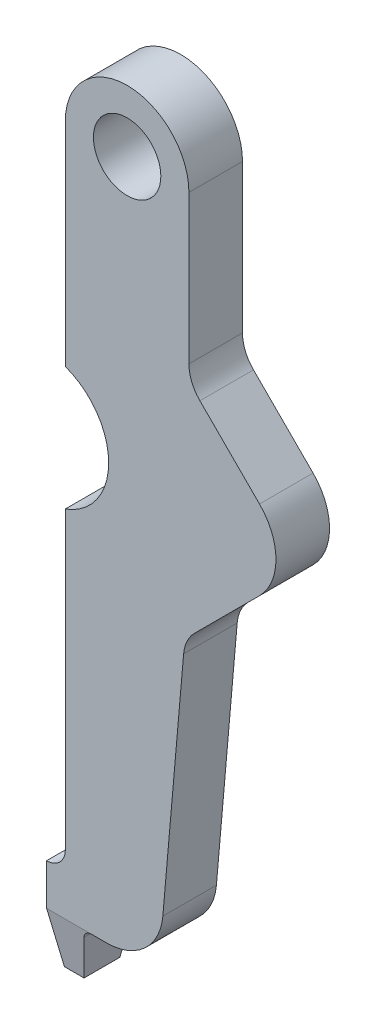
ISO-10303-21;
HEADER;
FILE_DESCRIPTION(('STEP AP214'),'2;1');
FILE_NAME('part.step','',(''),(''),'','','');
FILE_SCHEMA(('AUTOMOTIVE_DESIGN { 1 0 10303 214 1 1 1 1 }'));
ENDSEC;
DATA;
#1=APPLICATION_CONTEXT('core data for automotive mechanical design processes');
#2=APPLICATION_PROTOCOL_DEFINITION('international standard','automotive_design',2000,#1);
#3=PRODUCT_CONTEXT('',#1,'mechanical');
#4=PRODUCT('Part','Part','',(#3));
#5=PRODUCT_RELATED_PRODUCT_CATEGORY('part','',(#4));
#6=PRODUCT_DEFINITION_FORMATION('','',#4);
#7=PRODUCT_DEFINITION_CONTEXT('part definition',#1,'design');
#8=PRODUCT_DEFINITION('design','',#6,#7);
#9=PRODUCT_DEFINITION_SHAPE('','',#8);
#10=(LENGTH_UNIT() NAMED_UNIT(*) SI_UNIT(.MILLI.,.METRE.));
#11=(NAMED_UNIT(*) PLANE_ANGLE_UNIT() SI_UNIT($,.RADIAN.));
#12=(NAMED_UNIT(*) SI_UNIT($,.STERADIAN.) SOLID_ANGLE_UNIT());
#13=UNCERTAINTY_MEASURE_WITH_UNIT(LENGTH_MEASURE(1.E-05),#10,'distance_accuracy_value','');
#14=(GEOMETRIC_REPRESENTATION_CONTEXT(3) GLOBAL_UNCERTAINTY_ASSIGNED_CONTEXT((#13)) GLOBAL_UNIT_ASSIGNED_CONTEXT((#10,
#11,#12)) REPRESENTATION_CONTEXT('',''));
#15=CARTESIAN_POINT('',(0.,0.,0.));
#16=DIRECTION('',(0.,0.,1.));
#17=DIRECTION('',(1.,0.,0.));
#18=AXIS2_PLACEMENT_3D('',#15,#16,#17);
#19=CARTESIAN_POINT('',(0.,0.,1.8161));
#20=DIRECTION('',(1.,0.,0.));
#21=DIRECTION('',(0.,0.,-1.));
#22=AXIS2_PLACEMENT_3D('',#19,#20,#21);
#23=PLANE('',#22);
#24=DIRECTION('',(0.,-1.,0.));
#25=VECTOR('',#24,1.);
#26=CARTESIAN_POINT('',(0.,0.,-1.8161));
#27=LINE('',#26,#25);
#28=CARTESIAN_POINT('',(0.,44.069,-1.8161));
#29=VERTEX_POINT('',#28);
#30=CARTESIAN_POINT('',(0.,29.6532687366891,-1.8161));
#31=VERTEX_POINT('',#30);
#32=EDGE_CURVE('E187',#29,#31,#27,.T.);
#33=ORIENTED_EDGE('',*,*,#32,.T.);
#34=DIRECTION('',(0.,0.,1.));
#35=VECTOR('',#34,1.);
#36=CARTESIAN_POINT('',(0.,29.6532687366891,-1.8161));
#37=LINE('',#36,#35);
#38=CARTESIAN_POINT('',(0.,29.6532687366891,1.8161));
#39=VERTEX_POINT('',#38);
#40=EDGE_CURVE('E58',#31,#39,#37,.T.);
#41=ORIENTED_EDGE('',*,*,#40,.T.);
#42=DIRECTION('',(0.,-1.,0.));
#43=VECTOR('',#42,1.);
#44=CARTESIAN_POINT('',(0.,0.,1.8161));
#45=LINE('',#44,#43);
#46=CARTESIAN_POINT('',(0.,44.069,1.8161));
#47=VERTEX_POINT('',#46);
#48=EDGE_CURVE('E200',#47,#39,#45,.T.);
#49=ORIENTED_EDGE('',*,*,#48,.F.);
#50=DIRECTION('',(0.,0.,-1.));
#51=VECTOR('',#50,1.);
#52=CARTESIAN_POINT('',(0.,44.069,1.8161));
#53=LINE('',#52,#51);
#54=EDGE_CURVE('E203',#47,#29,#53,.T.);
#55=ORIENTED_EDGE('',*,*,#54,.T.);
#56=EDGE_LOOP('',(#33,#41,#49,#55));
#57=FACE_BOUND('',#56,.T.);
#58=ADVANCED_FACE('F41',(#57),#23,.F.);
#59=CARTESIAN_POINT('',(6.5532,-2.794,1.8161));
#60=DIRECTION('',(0.,1.,0.));
#61=DIRECTION('',(-1.,0.,0.));
#62=AXIS2_PLACEMENT_3D('',#59,#60,#61);
#63=PLANE('',#62);
#64=DIRECTION('',(-1.,0.,0.));
#65=VECTOR('',#64,1.);
#66=CARTESIAN_POINT('',(6.5532,-2.794,1.8161));
#67=LINE('',#66,#65);
#68=CARTESIAN_POINT('',(2.81753490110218,-2.794,1.8161));
#69=VERTEX_POINT('',#68);
#70=CARTESIAN_POINT('',(1.80282826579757,-2.794,1.8161));
#71=VERTEX_POINT('',#70);
#72=EDGE_CURVE('E251',#69,#71,#67,.T.);
#73=ORIENTED_EDGE('',*,*,#72,.T.);
#74=DIRECTION('',(0.,0.,-1.));
#75=VECTOR('',#74,1.);
#76=CARTESIAN_POINT('',(1.80282826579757,-2.794,-1.8161));
#77=LINE('',#76,#75);
#78=CARTESIAN_POINT('',(1.80282826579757,-2.794,-1.8161));
#79=VERTEX_POINT('',#78);
#80=EDGE_CURVE('E227',#71,#79,#77,.T.);
#81=ORIENTED_EDGE('',*,*,#80,.T.);
#82=DIRECTION('',(1.,0.,0.));
#83=VECTOR('',#82,1.);
#84=CARTESIAN_POINT('',(6.5532,-2.794,-1.8161));
#85=LINE('',#84,#83);
#86=CARTESIAN_POINT('',(2.81753490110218,-2.794,-1.8161));
#87=VERTEX_POINT('',#86);
#88=EDGE_CURVE('E211',#79,#87,#85,.T.);
#89=ORIENTED_EDGE('',*,*,#88,.T.);
#90=DIRECTION('',(0.,0.,1.));
#91=VECTOR('',#90,1.);
#92=CARTESIAN_POINT('',(2.81753490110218,-2.794,1.8161));
#93=LINE('',#92,#91);
#94=EDGE_CURVE('E282',#87,#69,#93,.T.);
#95=ORIENTED_EDGE('',*,*,#94,.T.);
#96=EDGE_LOOP('',(#73,#81,#89,#95));
#97=FACE_BOUND('',#96,.T.);
#98=ADVANCED_FACE('F317',(#97),#63,.F.);
#99=CARTESIAN_POINT('',(8.10282910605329,17.7123417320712,1.8161));
#100=DIRECTION('',(-0.996194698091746,0.0871557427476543,0.));
#101=DIRECTION('',(-0.0871557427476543,-0.996194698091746,0.));
#102=AXIS2_PLACEMENT_3D('',#99,#100,#101);
#103=PLANE('',#102);
#104=DIRECTION('',(0.0871557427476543,0.996194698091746,0.));
#105=VECTOR('',#104,1.);
#106=CARTESIAN_POINT('',(8.10282910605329,17.7123417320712,1.8161));
#107=LINE('',#106,#105);
#108=CARTESIAN_POINT('',(6.61303670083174,0.683936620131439,1.8161));
#109=VERTEX_POINT('',#108);
#110=CARTESIAN_POINT('',(8.0222549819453,16.7913752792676,1.8161));
#111=VERTEX_POINT('',#110);
#112=EDGE_CURVE('E190',#109,#111,#107,.T.);
#113=ORIENTED_EDGE('',*,*,#112,.F.);
#114=DIRECTION('',(0.,0.,1.));
#115=VECTOR('',#114,1.);
#116=CARTESIAN_POINT('',(6.61303670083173,0.683936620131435,1.8161));
#117=LINE('',#116,#115);
#118=CARTESIAN_POINT('',(6.61303670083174,0.683936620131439,-1.8161));
#119=VERTEX_POINT('',#118);
#120=EDGE_CURVE('E288',#109,#119,#117,.F.);
#121=ORIENTED_EDGE('',*,*,#120,.T.);
#122=DIRECTION('',(0.0871557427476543,0.996194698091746,0.));
#123=VECTOR('',#122,1.);
#124=CARTESIAN_POINT('',(8.10282910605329,17.7123417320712,-1.8161));
#125=LINE('',#124,#123);
#126=CARTESIAN_POINT('',(8.0222549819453,16.7913752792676,-1.8161));
#127=VERTEX_POINT('',#126);
#128=EDGE_CURVE('E249',#119,#127,#125,.T.);
#129=ORIENTED_EDGE('',*,*,#128,.T.);
#130=DIRECTION('',(0.,0.,-1.));
#131=VECTOR('',#130,1.);
#132=CARTESIAN_POINT('',(8.0222549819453,16.7913752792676,1.8161));
#133=LINE('',#132,#131);
#134=EDGE_CURVE('E356',#127,#111,#133,.F.);
#135=ORIENTED_EDGE('',*,*,#134,.T.);
#136=EDGE_LOOP('',(#113,#121,#129,#135));
#137=FACE_BOUND('',#136,.T.);
#138=ADVANCED_FACE('F402',(#137),#103,.F.);
#139=CARTESIAN_POINT('',(8.10282910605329,17.7123417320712,1.8161));
#140=DIRECTION('',(-0.707106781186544,0.707106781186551,0.));
#141=DIRECTION('',(-0.707106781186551,-0.707106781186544,0.));
#142=AXIS2_PLACEMENT_3D('',#139,#140,#141);
#143=PLANE('',#142);
#144=DIRECTION('',(0.707106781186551,0.707106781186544,0.));
#145=VECTOR('',#144,1.);
#146=CARTESIAN_POINT('',(8.10282910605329,17.7123417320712,1.8161));
#147=LINE('',#146,#145);
#148=CARTESIAN_POINT('',(8.75653829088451,18.3660509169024,1.8161));
#149=VERTEX_POINT('',#148);
#150=CARTESIAN_POINT('',(13.1670591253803,22.7765717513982,1.8161));
#151=VERTEX_POINT('',#150);
#152=EDGE_CURVE('E321',#149,#151,#147,.T.);
#153=ORIENTED_EDGE('',*,*,#152,.F.);
#154=DIRECTION('',(0.,0.,-1.));
#155=VECTOR('',#154,1.);
#156=CARTESIAN_POINT('',(8.75653829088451,18.3660509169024,-1.8161));
#157=LINE('',#156,#155);
#158=CARTESIAN_POINT('',(8.75653829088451,18.3660509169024,-1.8161));
#159=VERTEX_POINT('',#158);
#160=EDGE_CURVE('E353',#149,#159,#157,.T.);
#161=ORIENTED_EDGE('',*,*,#160,.T.);
#162=DIRECTION('',(0.707106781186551,0.707106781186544,0.));
#163=VECTOR('',#162,1.);
#164=CARTESIAN_POINT('',(8.10282910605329,17.7123417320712,-1.8161));
#165=LINE('',#164,#163);
#166=CARTESIAN_POINT('',(13.1670591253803,22.7765717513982,-1.8161));
#167=VERTEX_POINT('',#166);
#168=EDGE_CURVE('E331',#159,#167,#165,.T.);
#169=ORIENTED_EDGE('',*,*,#168,.T.);
#170=DIRECTION('',(0.,0.,-1.));
#171=VECTOR('',#170,1.);
#172=CARTESIAN_POINT('',(13.1670591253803,22.7765717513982,1.8161));
#173=LINE('',#172,#171);
#174=EDGE_CURVE('E348',#167,#151,#173,.F.);
#175=ORIENTED_EDGE('',*,*,#174,.T.);
#176=EDGE_LOOP('',(#153,#161,#169,#175));
#177=FACE_BOUND('',#176,.T.);
#178=ADVANCED_FACE('F395',(#177),#143,.F.);
#179=CARTESIAN_POINT('',(15.861135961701,25.4706485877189,1.8161));
#180=DIRECTION('',(-0.707106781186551,-0.707106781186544,0.));
#181=DIRECTION('',(0.707106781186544,-0.707106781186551,0.));
#182=AXIS2_PLACEMENT_3D('',#179,#180,#181);
#183=PLANE('',#182);
#184=DIRECTION('',(-0.707106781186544,0.707106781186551,0.));
#185=VECTOR('',#184,1.);
#186=CARTESIAN_POINT('',(15.861135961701,25.4706485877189,-1.8161));
#187=LINE('',#186,#185);
#188=CARTESIAN_POINT('',(13.1670591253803,28.1647254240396,-1.8161));
#189=VERTEX_POINT('',#188);
#190=CARTESIAN_POINT('',(9.12594877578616,32.2058357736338,-1.8161));
#191=VERTEX_POINT('',#190);
#192=EDGE_CURVE('E333',#189,#191,#187,.T.);
#193=ORIENTED_EDGE('',*,*,#192,.T.);
#194=DIRECTION('',(0.,0.,-1.));
#195=VECTOR('',#194,1.);
#196=CARTESIAN_POINT('',(9.12594877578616,32.2058357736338,1.8161));
#197=LINE('',#196,#195);
#198=CARTESIAN_POINT('',(9.12594877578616,32.2058357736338,1.8161));
#199=VERTEX_POINT('',#198);
#200=EDGE_CURVE('E362',#191,#199,#197,.F.);
#201=ORIENTED_EDGE('',*,*,#200,.T.);
#202=DIRECTION('',(-0.707106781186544,0.707106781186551,0.));
#203=VECTOR('',#202,1.);
#204=CARTESIAN_POINT('',(15.861135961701,25.4706485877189,1.8161));
#205=LINE('',#204,#203);
#206=CARTESIAN_POINT('',(13.1670591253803,28.1647254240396,1.8161));
#207=VERTEX_POINT('',#206);
#208=EDGE_CURVE('E323',#207,#199,#205,.T.);
#209=ORIENTED_EDGE('',*,*,#208,.F.);
#210=DIRECTION('',(0.,0.,-1.));
#211=VECTOR('',#210,1.);
#212=CARTESIAN_POINT('',(13.1670591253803,28.1647254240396,1.8161));
#213=LINE('',#212,#211);
#214=EDGE_CURVE('E342',#207,#189,#213,.T.);
#215=ORIENTED_EDGE('',*,*,#214,.T.);
#216=EDGE_LOOP('',(#193,#201,#209,#215));
#217=FACE_BOUND('',#216,.T.);
#218=ADVANCED_FACE('F385',(#217),#183,.F.);
#219=CARTESIAN_POINT('',(8.382,44.069,1.8161));
#220=DIRECTION('',(-1.,0.,0.));
#221=DIRECTION('',(0.,-1.,0.));
#222=AXIS2_PLACEMENT_3D('',#219,#220,#221);
#223=PLANE('',#222);
#224=DIRECTION('',(0.,1.,0.));
#225=VECTOR('',#224,1.);
#226=CARTESIAN_POINT('',(8.382,44.069,1.8161));
#227=LINE('',#226,#225);
#228=CARTESIAN_POINT('',(8.382,34.0018869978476,1.8161));
#229=VERTEX_POINT('',#228);
#230=CARTESIAN_POINT('',(8.382,44.069,1.8161));
#231=VERTEX_POINT('',#230);
#232=EDGE_CURVE('E326',#229,#231,#227,.T.);
#233=ORIENTED_EDGE('',*,*,#232,.F.);
#234=DIRECTION('',(0.,0.,-1.));
#235=VECTOR('',#234,1.);
#236=CARTESIAN_POINT('',(8.382,34.0018869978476,-1.8161));
#237=LINE('',#236,#235);
#238=CARTESIAN_POINT('',(8.382,34.0018869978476,-1.8161));
#239=VERTEX_POINT('',#238);
#240=EDGE_CURVE('E359',#229,#239,#237,.T.);
#241=ORIENTED_EDGE('',*,*,#240,.T.);
#242=DIRECTION('',(0.,1.,0.));
#243=VECTOR('',#242,1.);
#244=CARTESIAN_POINT('',(8.382,44.069,-1.8161));
#245=LINE('',#244,#243);
#246=CARTESIAN_POINT('',(8.382,44.069,-1.8161));
#247=VERTEX_POINT('',#246);
#248=EDGE_CURVE('E192',#239,#247,#245,.T.);
#249=ORIENTED_EDGE('',*,*,#248,.T.);
#250=DIRECTION('',(0.,0.,-1.));
#251=VECTOR('',#250,1.);
#252=CARTESIAN_POINT('',(8.382,44.069,1.8161));
#253=LINE('',#252,#251);
#254=EDGE_CURVE('E339',#231,#247,#253,.T.);
#255=ORIENTED_EDGE('',*,*,#254,.F.);
#256=EDGE_LOOP('',(#233,#241,#249,#255));
#257=FACE_BOUND('',#256,.T.);
#258=ADVANCED_FACE('F378',(#257),#223,.F.);
#259=CARTESIAN_POINT('',(4.191,44.069,1.8161));
#260=DIRECTION('',(0.,0.,-1.));
#261=DIRECTION('',(-1.,0.,0.));
#262=AXIS2_PLACEMENT_3D('',#259,#260,#261);
#263=CYLINDRICAL_SURFACE('',#262,4.191);
#264=CARTESIAN_POINT('',(4.191,44.069,-1.8161));
#265=DIRECTION('',(0.,0.,1.));
#266=DIRECTION('',(1.,0.,0.));
#267=AXIS2_PLACEMENT_3D('',#264,#265,#266);
#268=CIRCLE('',#267,4.191);
#269=EDGE_CURVE('E188',#247,#29,#268,.T.);
#270=ORIENTED_EDGE('',*,*,#269,.T.);
#271=ORIENTED_EDGE('',*,*,#54,.F.);
#272=CARTESIAN_POINT('',(4.191,44.069,1.8161));
#273=DIRECTION('',(0.,0.,1.));
#274=DIRECTION('',(1.,0.,0.));
#275=AXIS2_PLACEMENT_3D('',#272,#273,#274);
#276=CIRCLE('',#275,4.191);
#277=EDGE_CURVE('E328',#231,#47,#276,.T.);
#278=ORIENTED_EDGE('',*,*,#277,.F.);
#279=ORIENTED_EDGE('',*,*,#254,.T.);
#280=EDGE_LOOP('',(#270,#271,#278,#279));
#281=FACE_BOUND('',#280,.T.);
#282=ADVANCED_FACE('F425',(#281),#263,.T.);
#283=CARTESIAN_POINT('',(0.,21.2880284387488,1.8161));
#284=VERTEX_POINT('',#283);
#285=CARTESIAN_POINT('',(0.,1.27,1.8161));
#286=VERTEX_POINT('',#285);
#287=EDGE_CURVE('E45',#284,#286,#45,.T.);
#288=ORIENTED_EDGE('',*,*,#287,.F.);
#289=DIRECTION('',(0.,0.,1.));
#290=VECTOR('',#289,1.);
#291=CARTESIAN_POINT('',(0.,21.2880284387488,-1.8161));
#292=LINE('',#291,#290);
#293=CARTESIAN_POINT('',(0.,21.2880284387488,-1.8161));
#294=VERTEX_POINT('',#293);
#295=EDGE_CURVE('E172',#284,#294,#292,.F.);
#296=ORIENTED_EDGE('',*,*,#295,.T.);
#297=CARTESIAN_POINT('',(0.,1.27,-1.8161));
#298=VERTEX_POINT('',#297);
#299=EDGE_CURVE('E179',#294,#298,#27,.T.);
#300=ORIENTED_EDGE('',*,*,#299,.T.);
#301=DIRECTION('',(0.,0.,-1.));
#302=VECTOR('',#301,1.);
#303=CARTESIAN_POINT('',(0.,1.27,1.8161));
#304=LINE('',#303,#302);
#305=EDGE_CURVE('E235',#298,#286,#304,.F.);
#306=ORIENTED_EDGE('',*,*,#305,.T.);
#307=EDGE_LOOP('',(#288,#296,#300,#306));
#308=FACE_BOUND('',#307,.T.);
#309=ADVANCED_FACE('F178',(#308),#23,.F.);
#310=CARTESIAN_POINT('',(4.191,44.069,1.8161));
#311=DIRECTION('',(0.,0.,1.));
#312=DIRECTION('',(1.,0.,0.));
#313=AXIS2_PLACEMENT_3D('',#310,#311,#312);
#314=PLANE('',#313);
#315=CARTESIAN_POINT('',(-1.50456428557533,25.4706485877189,1.8161));
#316=DIRECTION('',(0.,0.,1.));
#317=DIRECTION('',(1.,0.,0.));
#318=AXIS2_PLACEMENT_3D('',#315,#316,#317);
#319=CIRCLE('',#318,4.445);
#320=EDGE_CURVE('E181',#284,#39,#319,.T.);
#321=ORIENTED_EDGE('',*,*,#320,.F.);
#322=ORIENTED_EDGE('',*,*,#287,.T.);
#323=CARTESIAN_POINT('',(-1.27,1.27,1.8161));
#324=DIRECTION('',(0.,0.,1.));
#325=DIRECTION('',(1.,0.,0.));
#326=AXIS2_PLACEMENT_3D('',#323,#324,#325);
#327=CIRCLE('',#326,1.27);
#328=CARTESIAN_POINT('',(-1.27,0.,1.8161));
#329=VERTEX_POINT('',#328);
#330=EDGE_CURVE('E51',#286,#329,#327,.F.);
#331=ORIENTED_EDGE('',*,*,#330,.T.);
#332=DIRECTION('',(0.,1.,0.));
#333=VECTOR('',#332,1.);
#334=CARTESIAN_POINT('',(-1.27,-2.794,1.8161));
#335=LINE('',#334,#333);
#336=CARTESIAN_POINT('',(-1.27,-2.794,1.8161));
#337=VERTEX_POINT('',#336);
#338=EDGE_CURVE('E240',#337,#329,#335,.T.);
#339=ORIENTED_EDGE('',*,*,#338,.F.);
#340=DIRECTION('',(-1.,0.,0.));
#341=VECTOR('',#340,1.);
#342=CARTESIAN_POINT('',(-1.27,-2.794,1.8161));
#343=LINE('',#342,#341);
#344=EDGE_CURVE('E274',#71,#337,#343,.T.);
#345=ORIENTED_EDGE('',*,*,#344,.F.);
#346=ORIENTED_EDGE('',*,*,#72,.F.);
#347=CARTESIAN_POINT('',(2.81753490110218,1.016,1.8161));
#348=DIRECTION('',(0.,0.,1.));
#349=DIRECTION('',(1.,0.,0.));
#350=AXIS2_PLACEMENT_3D('',#347,#348,#349);
#351=CIRCLE('',#350,3.81);
#352=EDGE_CURVE('E285',#69,#109,#351,.T.);
#353=ORIENTED_EDGE('',*,*,#352,.T.);
#354=ORIENTED_EDGE('',*,*,#112,.T.);
#355=CARTESIAN_POINT('',(10.5525895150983,16.5699996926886,1.8161));
#356=DIRECTION('',(0.,0.,1.));
#357=DIRECTION('',(1.,0.,0.));
#358=AXIS2_PLACEMENT_3D('',#355,#356,#357);
#359=CIRCLE('',#358,2.54);
#360=EDGE_CURVE('E367',#111,#149,#359,.F.);
#361=ORIENTED_EDGE('',*,*,#360,.T.);
#362=ORIENTED_EDGE('',*,*,#152,.T.);
#363=CARTESIAN_POINT('',(10.4729822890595,25.4706485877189,1.8161));
#364=DIRECTION('',(0.,0.,1.));
#365=DIRECTION('',(1.,0.,0.));
#366=AXIS2_PLACEMENT_3D('',#363,#364,#365);
#367=CIRCLE('',#366,3.81);
#368=EDGE_CURVE('E351',#151,#207,#367,.T.);
#369=ORIENTED_EDGE('',*,*,#368,.T.);
#370=ORIENTED_EDGE('',*,*,#208,.T.);
#371=CARTESIAN_POINT('',(10.922,34.0018869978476,1.8161));
#372=DIRECTION('',(0.,0.,1.));
#373=DIRECTION('',(1.,0.,0.));
#374=AXIS2_PLACEMENT_3D('',#371,#372,#373);
#375=CIRCLE('',#374,2.54);
#376=EDGE_CURVE('E286',#199,#229,#375,.F.);
#377=ORIENTED_EDGE('',*,*,#376,.T.);
#378=ORIENTED_EDGE('',*,*,#232,.T.);
#379=ORIENTED_EDGE('',*,*,#277,.T.);
#380=ORIENTED_EDGE('',*,*,#48,.T.);
#381=EDGE_LOOP('',(#321,#322,#331,#339,#345,#346,#353,#354,#361,#362,#369,#370,#377,#378,#379,#380));
#382=FACE_BOUND('',#381,.T.);
#383=CARTESIAN_POINT('',(4.191,44.069,1.8161));
#384=DIRECTION('',(0.,0.,1.));
#385=DIRECTION('',(1.,0.,0.));
#386=AXIS2_PLACEMENT_3D('',#383,#384,#385);
#387=CIRCLE('',#386,2.286);
#388=CARTESIAN_POINT('',(6.477,44.069,1.8161));
#389=VERTEX_POINT('',#388);
#390=EDGE_CURVE('E263',#389,#389,#387,.T.);
#391=ORIENTED_EDGE('',*,*,#390,.F.);
#392=EDGE_LOOP('',(#391));
#393=FACE_BOUND('',#392,.T.);
#394=ADVANCED_FACE('F238',(#382,#393),#314,.T.);
#395=CARTESIAN_POINT('',(4.191,44.069,-1.8161));
#396=DIRECTION('',(0.,0.,1.));
#397=DIRECTION('',(1.,0.,0.));
#398=AXIS2_PLACEMENT_3D('',#395,#396,#397);
#399=PLANE('',#398);
#400=CARTESIAN_POINT('',(4.191,44.069,-1.8161));
#401=DIRECTION('',(0.,0.,1.));
#402=DIRECTION('',(1.,0.,0.));
#403=AXIS2_PLACEMENT_3D('',#400,#401,#402);
#404=CIRCLE('',#403,2.286);
#405=CARTESIAN_POINT('',(6.477,44.069,-1.8161));
#406=VERTEX_POINT('',#405);
#407=EDGE_CURVE('E406',#406,#406,#404,.T.);
#408=ORIENTED_EDGE('',*,*,#407,.T.);
#409=EDGE_LOOP('',(#408));
#410=FACE_BOUND('',#409,.T.);
#411=ORIENTED_EDGE('',*,*,#299,.F.);
#412=CARTESIAN_POINT('',(-1.50456428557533,25.4706485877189,-1.8161));
#413=DIRECTION('',(0.,0.,1.));
#414=DIRECTION('',(1.,0.,0.));
#415=AXIS2_PLACEMENT_3D('',#412,#413,#414);
#416=CIRCLE('',#415,4.445);
#417=EDGE_CURVE('E12',#294,#31,#416,.T.);
#418=ORIENTED_EDGE('',*,*,#417,.T.);
#419=ORIENTED_EDGE('',*,*,#32,.F.);
#420=ORIENTED_EDGE('',*,*,#269,.F.);
#421=ORIENTED_EDGE('',*,*,#248,.F.);
#422=CARTESIAN_POINT('',(10.922,34.0018869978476,-1.8161));
#423=DIRECTION('',(0.,0.,1.));
#424=DIRECTION('',(1.,0.,0.));
#425=AXIS2_PLACEMENT_3D('',#422,#423,#424);
#426=CIRCLE('',#425,2.54);
#427=EDGE_CURVE('E369',#239,#191,#426,.T.);
#428=ORIENTED_EDGE('',*,*,#427,.T.);
#429=ORIENTED_EDGE('',*,*,#192,.F.);
#430=CARTESIAN_POINT('',(10.4729822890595,25.4706485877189,-1.8161));
#431=DIRECTION('',(0.,0.,1.));
#432=DIRECTION('',(1.,0.,0.));
#433=AXIS2_PLACEMENT_3D('',#430,#431,#432);
#434=CIRCLE('',#433,3.81);
#435=EDGE_CURVE('E345',#189,#167,#434,.F.);
#436=ORIENTED_EDGE('',*,*,#435,.T.);
#437=ORIENTED_EDGE('',*,*,#168,.F.);
#438=CARTESIAN_POINT('',(10.5525895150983,16.5699996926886,-1.8161));
#439=DIRECTION('',(0.,0.,1.));
#440=DIRECTION('',(1.,0.,0.));
#441=AXIS2_PLACEMENT_3D('',#438,#439,#440);
#442=CIRCLE('',#441,2.54);
#443=EDGE_CURVE('E364',#159,#127,#442,.T.);
#444=ORIENTED_EDGE('',*,*,#443,.T.);
#445=ORIENTED_EDGE('',*,*,#128,.F.);
#446=CARTESIAN_POINT('',(2.81753490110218,1.016,-1.8161));
#447=DIRECTION('',(0.,0.,1.));
#448=DIRECTION('',(1.,0.,0.));
#449=AXIS2_PLACEMENT_3D('',#446,#447,#448);
#450=CIRCLE('',#449,3.81);
#451=EDGE_CURVE('E289',#119,#87,#450,.F.);
#452=ORIENTED_EDGE('',*,*,#451,.T.);
#453=ORIENTED_EDGE('',*,*,#88,.F.);
#454=CARTESIAN_POINT('',(-1.27,-2.794,-1.8161));
#455=VERTEX_POINT('',#454);
#456=EDGE_CURVE('E206',#455,#79,#85,.T.);
#457=ORIENTED_EDGE('',*,*,#456,.F.);
#458=DIRECTION('',(0.,1.,0.));
#459=VECTOR('',#458,1.);
#460=CARTESIAN_POINT('',(-1.27,-2.794,-1.8161));
#461=LINE('',#460,#459);
#462=CARTESIAN_POINT('',(-1.27,0.,-1.8161));
#463=VERTEX_POINT('',#462);
#464=EDGE_CURVE('E210',#455,#463,#461,.T.);
#465=ORIENTED_EDGE('',*,*,#464,.T.);
#466=CARTESIAN_POINT('',(-1.27,1.27,-1.8161));
#467=DIRECTION('',(0.,0.,1.));
#468=DIRECTION('',(1.,0.,0.));
#469=AXIS2_PLACEMENT_3D('',#466,#467,#468);
#470=CIRCLE('',#469,1.27);
#471=EDGE_CURVE('E185',#463,#298,#470,.T.);
#472=ORIENTED_EDGE('',*,*,#471,.T.);
#473=EDGE_LOOP('',(#411,#418,#419,#420,#421,#428,#429,#436,#437,#444,#445,#452,#453,#457,#465,#472));
#474=FACE_BOUND('',#473,.T.);
#475=ADVANCED_FACE('F183',(#410,#474),#399,.F.);
#476=CARTESIAN_POINT('',(10.4729822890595,25.4706485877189,1.8161));
#477=DIRECTION('',(0.,0.,-1.));
#478=DIRECTION('',(-1.,0.,0.));
#479=AXIS2_PLACEMENT_3D('',#476,#477,#478);
#480=CYLINDRICAL_SURFACE('',#479,3.81);
#481=ORIENTED_EDGE('',*,*,#368,.F.);
#482=ORIENTED_EDGE('',*,*,#174,.F.);
#483=ORIENTED_EDGE('',*,*,#435,.F.);
#484=ORIENTED_EDGE('',*,*,#214,.F.);
#485=EDGE_LOOP('',(#481,#482,#483,#484));
#486=FACE_BOUND('',#485,.T.);
#487=ADVANCED_FACE('F389',(#486),#480,.T.);
#488=CARTESIAN_POINT('',(10.5525895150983,16.5699996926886,1.8161));
#489=DIRECTION('',(0.,0.,1.));
#490=DIRECTION('',(1.,0.,0.));
#491=AXIS2_PLACEMENT_3D('',#488,#489,#490);
#492=CYLINDRICAL_SURFACE('',#491,2.54);
#493=ORIENTED_EDGE('',*,*,#360,.F.);
#494=ORIENTED_EDGE('',*,*,#134,.F.);
#495=ORIENTED_EDGE('',*,*,#443,.F.);
#496=ORIENTED_EDGE('',*,*,#160,.F.);
#497=EDGE_LOOP('',(#493,#494,#495,#496));
#498=FACE_BOUND('',#497,.T.);
#499=ADVANCED_FACE('F399',(#498),#492,.F.);
#500=CARTESIAN_POINT('',(10.922,34.0018869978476,1.8161));
#501=DIRECTION('',(0.,0.,1.));
#502=DIRECTION('',(1.,0.,0.));
#503=AXIS2_PLACEMENT_3D('',#500,#501,#502);
#504=CYLINDRICAL_SURFACE('',#503,2.54);
#505=ORIENTED_EDGE('',*,*,#376,.F.);
#506=ORIENTED_EDGE('',*,*,#200,.F.);
#507=ORIENTED_EDGE('',*,*,#427,.F.);
#508=ORIENTED_EDGE('',*,*,#240,.F.);
#509=EDGE_LOOP('',(#505,#506,#507,#508));
#510=FACE_BOUND('',#509,.T.);
#511=ADVANCED_FACE('F381',(#510),#504,.F.);
#512=CARTESIAN_POINT('',(-1.27,-2.794,1.8161));
#513=DIRECTION('',(1.,0.,0.));
#514=DIRECTION('',(0.,0.,-1.));
#515=AXIS2_PLACEMENT_3D('',#512,#513,#514);
#516=PLANE('',#515);
#517=DIRECTION('',(0.,0.,-1.));
#518=VECTOR('',#517,1.);
#519=CARTESIAN_POINT('',(-1.27,0.,1.8161));
#520=LINE('',#519,#518);
#521=EDGE_CURVE('E219',#329,#463,#520,.T.);
#522=ORIENTED_EDGE('',*,*,#521,.T.);
#523=ORIENTED_EDGE('',*,*,#464,.F.);
#524=DIRECTION('',(0.,0.,-1.));
#525=VECTOR('',#524,1.);
#526=CARTESIAN_POINT('',(-1.27,-2.794,1.8161));
#527=LINE('',#526,#525);
#528=EDGE_CURVE('E217',#337,#455,#527,.T.);
#529=ORIENTED_EDGE('',*,*,#528,.F.);
#530=ORIENTED_EDGE('',*,*,#338,.T.);
#531=EDGE_LOOP('',(#522,#523,#529,#530));
#532=FACE_BOUND('',#531,.T.);
#533=ADVANCED_FACE('F246',(#532),#516,.F.);
#534=CARTESIAN_POINT('',(-1.27,-2.794,1.8161));
#535=DIRECTION('',(-0.984807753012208,-0.17364817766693,0.));
#536=DIRECTION('',(0.17364817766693,-0.984807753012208,0.));
#537=AXIS2_PLACEMENT_3D('',#534,#535,#536);
#538=PLANE('',#537);
#539=ORIENTED_EDGE('',*,*,#528,.T.);
#540=DIRECTION('',(-0.171087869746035,0.970287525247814,-0.171087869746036));
#541=VECTOR('',#540,1.);
#542=CARTESIAN_POINT('',(-1.27,-2.794,-1.8161));
#543=LINE('',#542,#541);
#544=CARTESIAN_POINT('',(-0.665374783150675,-6.223,-1.21147478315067));
#545=VERTEX_POINT('',#544);
#546=EDGE_CURVE('E252',#545,#455,#543,.T.);
#547=ORIENTED_EDGE('',*,*,#546,.F.);
#548=DIRECTION('',(0.,0.,1.));
#549=VECTOR('',#548,1.);
#550=CARTESIAN_POINT('',(-0.665374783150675,-6.223,1.8161));
#551=LINE('',#550,#549);
#552=CARTESIAN_POINT('',(-0.665374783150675,-6.223,1.21147478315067));
#553=VERTEX_POINT('',#552);
#554=EDGE_CURVE('E270',#553,#545,#551,.F.);
#555=ORIENTED_EDGE('',*,*,#554,.F.);
#556=DIRECTION('',(-0.171087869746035,0.970287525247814,0.171087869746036));
#557=VECTOR('',#556,1.);
#558=CARTESIAN_POINT('',(-1.27,-2.794,1.8161));
#559=LINE('',#558,#557);
#560=EDGE_CURVE('E266',#553,#337,#559,.T.);
#561=ORIENTED_EDGE('',*,*,#560,.T.);
#562=EDGE_LOOP('',(#539,#547,#555,#561));
#563=FACE_BOUND('',#562,.T.);
#564=ADVANCED_FACE('F445',(#563),#538,.T.);
#565=CARTESIAN_POINT('',(-1.27,-2.794,-1.8161));
#566=DIRECTION('',(0.,-0.17364817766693,-0.984807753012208));
#567=DIRECTION('',(0.,0.984807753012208,-0.17364817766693));
#568=AXIS2_PLACEMENT_3D('',#565,#566,#567);
#569=PLANE('',#568);
#570=ORIENTED_EDGE('',*,*,#456,.T.);
#571=CARTESIAN_POINT('',(1.80282826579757,-3.429,-1.70413236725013));
#572=DIRECTION('',(0.,-0.17364817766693,-0.984807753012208));
#573=DIRECTION('',(0.,-0.984807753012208,0.17364817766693));
#574=AXIS2_PLACEMENT_3D('',#571,#572,#573);
#575=ELLIPSE('',#574,0.644795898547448,0.635);
#576=CARTESIAN_POINT('',(1.17747534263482,-3.3187334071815,-1.72357534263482));
#577=VERTEX_POINT('',#576);
#578=EDGE_CURVE('E233',#79,#577,#575,.F.);
#579=ORIENTED_EDGE('',*,*,#578,.T.);
#580=DIRECTION('',(0.171087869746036,0.970287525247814,-0.171087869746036));
#581=VECTOR('',#580,1.);
#582=CARTESIAN_POINT('',(1.16368165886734,-3.39696127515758,-1.70978165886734));
#583=LINE('',#582,#581);
#584=CARTESIAN_POINT('',(0.665374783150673,-6.223,-1.21147478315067));
#585=VERTEX_POINT('',#584);
#586=EDGE_CURVE('E256',#585,#577,#583,.T.);
#587=ORIENTED_EDGE('',*,*,#586,.F.);
#588=DIRECTION('',(-1.,0.,0.));
#589=VECTOR('',#588,1.);
#590=CARTESIAN_POINT('',(-1.27,-6.223,-1.21147478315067));
#591=LINE('',#590,#589);
#592=EDGE_CURVE('E273',#545,#585,#591,.F.);
#593=ORIENTED_EDGE('',*,*,#592,.F.);
#594=ORIENTED_EDGE('',*,*,#546,.T.);
#595=EDGE_LOOP('',(#570,#579,#587,#593,#594));
#596=FACE_BOUND('',#595,.T.);
#597=ADVANCED_FACE('F313',(#596),#569,.T.);
#598=CARTESIAN_POINT('',(1.27,-2.794,1.8161));
#599=DIRECTION('',(0.984807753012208,-0.17364817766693,0.));
#600=DIRECTION('',(0.17364817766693,0.984807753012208,0.));
#601=AXIS2_PLACEMENT_3D('',#598,#599,#600);
#602=PLANE('',#601);
#603=ORIENTED_EDGE('',*,*,#586,.T.);
#604=DIRECTION('',(0.,0.,1.));
#605=VECTOR('',#604,1.);
#606=CARTESIAN_POINT('',(1.17747534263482,-3.3187334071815,1.8161));
#607=LINE('',#606,#605);
#608=CARTESIAN_POINT('',(1.17747534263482,-3.3187334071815,1.72357534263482));
#609=VERTEX_POINT('',#608);
#610=EDGE_CURVE('E225',#577,#609,#607,.T.);
#611=ORIENTED_EDGE('',*,*,#610,.T.);
#612=DIRECTION('',(0.171087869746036,0.970287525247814,0.171087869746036));
#613=VECTOR('',#612,1.);
#614=CARTESIAN_POINT('',(1.19565150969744,-3.21565124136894,1.74175150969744));
#615=LINE('',#614,#613);
#616=CARTESIAN_POINT('',(0.665374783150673,-6.223,1.21147478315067));
#617=VERTEX_POINT('',#616);
#618=EDGE_CURVE('E212',#617,#609,#615,.T.);
#619=ORIENTED_EDGE('',*,*,#618,.F.);
#620=DIRECTION('',(0.,0.,-1.));
#621=VECTOR('',#620,1.);
#622=CARTESIAN_POINT('',(0.665374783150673,-6.223,1.8161));
#623=LINE('',#622,#621);
#624=EDGE_CURVE('E276',#585,#617,#623,.F.);
#625=ORIENTED_EDGE('',*,*,#624,.F.);
#626=EDGE_LOOP('',(#603,#611,#619,#625));
#627=FACE_BOUND('',#626,.T.);
#628=ADVANCED_FACE('F300',(#627),#602,.T.);
#629=CARTESIAN_POINT('',(-1.27,-2.794,1.8161));
#630=DIRECTION('',(0.,-0.17364817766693,0.984807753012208));
#631=DIRECTION('',(0.,-0.984807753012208,-0.17364817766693));
#632=AXIS2_PLACEMENT_3D('',#629,#630,#631);
#633=PLANE('',#632);
#634=ORIENTED_EDGE('',*,*,#344,.T.);
#635=ORIENTED_EDGE('',*,*,#560,.F.);
#636=DIRECTION('',(1.,0.,0.));
#637=VECTOR('',#636,1.);
#638=CARTESIAN_POINT('',(-1.27,-6.223,1.21147478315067));
#639=LINE('',#638,#637);
#640=EDGE_CURVE('E269',#617,#553,#639,.F.);
#641=ORIENTED_EDGE('',*,*,#640,.F.);
#642=ORIENTED_EDGE('',*,*,#618,.T.);
#643=CARTESIAN_POINT('',(1.80282826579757,-3.429,1.70413236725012));
#644=DIRECTION('',(0.,-0.17364817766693,0.984807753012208));
#645=DIRECTION('',(0.,0.984807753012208,0.17364817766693));
#646=AXIS2_PLACEMENT_3D('',#643,#644,#645);
#647=ELLIPSE('',#646,0.644795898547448,0.635);
#648=EDGE_CURVE('E230',#609,#71,#647,.F.);
#649=ORIENTED_EDGE('',*,*,#648,.T.);
#650=EDGE_LOOP('',(#634,#635,#641,#642,#649));
#651=FACE_BOUND('',#650,.T.);
#652=ADVANCED_FACE('F307',(#651),#633,.T.);
#653=CARTESIAN_POINT('',(-1.27,-6.223,1.8161));
#654=DIRECTION('',(0.,-1.,0.));
#655=DIRECTION('',(0.,0.,-1.));
#656=AXIS2_PLACEMENT_3D('',#653,#654,#655);
#657=PLANE('',#656);
#658=ORIENTED_EDGE('',*,*,#554,.T.);
#659=ORIENTED_EDGE('',*,*,#592,.T.);
#660=ORIENTED_EDGE('',*,*,#624,.T.);
#661=ORIENTED_EDGE('',*,*,#640,.T.);
#662=EDGE_LOOP('',(#658,#659,#660,#661));
#663=FACE_BOUND('',#662,.T.);
#664=ADVANCED_FACE('F312',(#663),#657,.T.);
#665=CARTESIAN_POINT('',(2.81753490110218,1.016,1.8161));
#666=DIRECTION('',(0.,0.,1.));
#667=DIRECTION('',(0.,-1.,0.));
#668=AXIS2_PLACEMENT_3D('',#665,#666,#667);
#669=CYLINDRICAL_SURFACE('',#668,3.81);
#670=ORIENTED_EDGE('',*,*,#451,.F.);
#671=ORIENTED_EDGE('',*,*,#120,.F.);
#672=ORIENTED_EDGE('',*,*,#352,.F.);
#673=ORIENTED_EDGE('',*,*,#94,.F.);
#674=EDGE_LOOP('',(#670,#671,#672,#673));
#675=FACE_BOUND('',#674,.T.);
#676=ADVANCED_FACE('F405',(#675),#669,.T.);
#677=CARTESIAN_POINT('',(1.80282826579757,-3.429,1.8161));
#678=DIRECTION('',(0.,0.,1.));
#679=DIRECTION('',(1.,0.,0.));
#680=AXIS2_PLACEMENT_3D('',#677,#678,#679);
#681=CYLINDRICAL_SURFACE('',#680,0.635);
#682=ORIENTED_EDGE('',*,*,#578,.F.);
#683=ORIENTED_EDGE('',*,*,#80,.F.);
#684=ORIENTED_EDGE('',*,*,#648,.F.);
#685=ORIENTED_EDGE('',*,*,#610,.F.);
#686=EDGE_LOOP('',(#682,#683,#684,#685));
#687=FACE_BOUND('',#686,.T.);
#688=ADVANCED_FACE('F315',(#687),#681,.F.);
#689=CARTESIAN_POINT('',(-1.27,1.27,1.8161));
#690=DIRECTION('',(0.,0.,-1.));
#691=DIRECTION('',(0.,1.,0.));
#692=AXIS2_PLACEMENT_3D('',#689,#690,#691);
#693=CYLINDRICAL_SURFACE('',#692,1.27);
#694=ORIENTED_EDGE('',*,*,#330,.F.);
#695=ORIENTED_EDGE('',*,*,#305,.F.);
#696=ORIENTED_EDGE('',*,*,#471,.F.);
#697=ORIENTED_EDGE('',*,*,#521,.F.);
#698=EDGE_LOOP('',(#694,#695,#696,#697));
#699=FACE_BOUND('',#698,.T.);
#700=ADVANCED_FACE('F43',(#699),#693,.F.);
#701=CARTESIAN_POINT('',(4.191,44.069,-1.8161));
#702=DIRECTION('',(0.,0.,1.));
#703=DIRECTION('',(1.,0.,0.));
#704=AXIS2_PLACEMENT_3D('',#701,#702,#703);
#705=CYLINDRICAL_SURFACE('',#704,2.286);
#706=CARTESIAN_POINT('',(6.477,44.069,-1.8161));
#707=CARTESIAN_POINT('',(6.477,44.069,-1.77826458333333));
#708=CARTESIAN_POINT('',(6.477,44.069,-1.74042916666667));
#709=CARTESIAN_POINT('',(6.477,44.069,-1.66475833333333));
#710=CARTESIAN_POINT('',(6.477,44.069,-1.62692291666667));
#711=CARTESIAN_POINT('',(6.477,44.069,-1.55125208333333));
#712=CARTESIAN_POINT('',(6.477,44.069,-1.51341666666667));
#713=CARTESIAN_POINT('',(6.477,44.069,-1.43774583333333));
#714=CARTESIAN_POINT('',(6.477,44.069,-1.39991041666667));
#715=CARTESIAN_POINT('',(6.477,44.069,-1.32423958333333));
#716=CARTESIAN_POINT('',(6.477,44.069,-1.28640416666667));
#717=CARTESIAN_POINT('',(6.477,44.069,-1.21073333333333));
#718=CARTESIAN_POINT('',(6.477,44.069,-1.17289791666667));
#719=CARTESIAN_POINT('',(6.477,44.069,-1.09722708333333));
#720=CARTESIAN_POINT('',(6.477,44.069,-1.05939166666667));
#721=CARTESIAN_POINT('',(6.477,44.069,-0.983720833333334));
#722=CARTESIAN_POINT('',(6.477,44.069,-0.945885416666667));
#723=CARTESIAN_POINT('',(6.477,44.069,-0.870214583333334));
#724=CARTESIAN_POINT('',(6.477,44.069,-0.832379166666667));
#725=CARTESIAN_POINT('',(6.477,44.069,-0.756708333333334));
#726=CARTESIAN_POINT('',(6.477,44.069,-0.718872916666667));
#727=CARTESIAN_POINT('',(6.477,44.069,-0.643202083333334));
#728=CARTESIAN_POINT('',(6.477,44.069,-0.605366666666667));
#729=CARTESIAN_POINT('',(6.477,44.069,-0.529695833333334));
#730=CARTESIAN_POINT('',(6.477,44.069,-0.491860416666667));
#731=CARTESIAN_POINT('',(6.477,44.069,-0.416189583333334));
#732=CARTESIAN_POINT('',(6.477,44.069,-0.378354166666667));
#733=CARTESIAN_POINT('',(6.477,44.069,-0.302683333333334));
#734=CARTESIAN_POINT('',(6.477,44.069,-0.264847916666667));
#735=CARTESIAN_POINT('',(6.477,44.069,-0.189177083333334));
#736=CARTESIAN_POINT('',(6.477,44.069,-0.151341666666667));
#737=CARTESIAN_POINT('',(6.477,44.069,-0.075670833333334));
#738=CARTESIAN_POINT('',(6.477,44.069,-0.0378354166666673));
#739=CARTESIAN_POINT('',(6.477,44.069,0.037835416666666));
#740=CARTESIAN_POINT('',(6.477,44.069,0.0756708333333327));
#741=CARTESIAN_POINT('',(6.477,44.069,0.151341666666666));
#742=CARTESIAN_POINT('',(6.477,44.069,0.189177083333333));
#743=CARTESIAN_POINT('',(6.477,44.069,0.264847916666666));
#744=CARTESIAN_POINT('',(6.477,44.069,0.302683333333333));
#745=CARTESIAN_POINT('',(6.477,44.069,0.378354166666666));
#746=CARTESIAN_POINT('',(6.477,44.069,0.416189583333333));
#747=CARTESIAN_POINT('',(6.477,44.069,0.491860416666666));
#748=CARTESIAN_POINT('',(6.477,44.069,0.529695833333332));
#749=CARTESIAN_POINT('',(6.477,44.069,0.605366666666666));
#750=CARTESIAN_POINT('',(6.477,44.069,0.643202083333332));
#751=CARTESIAN_POINT('',(6.477,44.069,0.718872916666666));
#752=CARTESIAN_POINT('',(6.477,44.069,0.756708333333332));
#753=CARTESIAN_POINT('',(6.477,44.069,0.832379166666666));
#754=CARTESIAN_POINT('',(6.477,44.069,0.870214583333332));
#755=CARTESIAN_POINT('',(6.477,44.069,0.945885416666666));
#756=CARTESIAN_POINT('',(6.477,44.069,0.983720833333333));
#757=CARTESIAN_POINT('',(6.477,44.069,1.05939166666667));
#758=CARTESIAN_POINT('',(6.477,44.069,1.09722708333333));
#759=CARTESIAN_POINT('',(6.477,44.069,1.17289791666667));
#760=CARTESIAN_POINT('',(6.477,44.069,1.21073333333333));
#761=CARTESIAN_POINT('',(6.477,44.069,1.28640416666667));
#762=CARTESIAN_POINT('',(6.477,44.069,1.32423958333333));
#763=CARTESIAN_POINT('',(6.477,44.069,1.39991041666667));
#764=CARTESIAN_POINT('',(6.477,44.069,1.43774583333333));
#765=CARTESIAN_POINT('',(6.477,44.069,1.51341666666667));
#766=CARTESIAN_POINT('',(6.477,44.069,1.55125208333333));
#767=CARTESIAN_POINT('',(6.477,44.069,1.62692291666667));
#768=CARTESIAN_POINT('',(6.477,44.069,1.66475833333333));
#769=CARTESIAN_POINT('',(6.477,44.069,1.74042916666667));
#770=CARTESIAN_POINT('',(6.477,44.069,1.77826458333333));
#771=CARTESIAN_POINT('',(6.477,44.069,1.8161));
#772=B_SPLINE_CURVE_WITH_KNOTS('',3,(#706,#707,#708,#709,#710,#711,#712,#713,#714,#715,#716,
#717,#718,#719,#720,#721,#722,#723,#724,#725,#726,#727,#728,#729,#730,#731,#732,#733,#734,#735,
#736,#737,#738,#739,#740,#741,#742,#743,#744,#745,#746,#747,#748,#749,#750,#751,#752,#753,#754,
#755,#756,#757,#758,#759,#760,#761,#762,#763,#764,#765,#766,#767,#768,#769,#770,#771),
.UNSPECIFIED.,.F.,.F.,(4,2,2,2,2,2,2,2,2,2,2,2,2,2,2,2,2,2,2,2,2,2,2,2,2,2,2,2,2,2,2,2,4),(0.,
0.11350625,0.2270125,0.34051875,0.454025,0.56753125,0.6810375,0.79454375,0.90805,1.02155625,
1.1350625,1.24856875,1.362075,1.47558125,1.5890875,1.70259375,1.8161,1.92960625,2.0431125,
2.15661875,2.270125,2.38363125,2.4971375,2.61064375,2.72415,2.83765625,2.9511625,3.06466875,
3.178175,3.29168125,3.4051875,3.51869375,3.6322),.UNSPECIFIED.);
#773=EDGE_CURVE('BSEAM458',#406,#389,#772,.T.);
#774=ORIENTED_EDGE('',*,*,#407,.F.);
#775=ORIENTED_EDGE('',*,*,#390,.T.);
#776=ORIENTED_EDGE('',*,*,#773,.T.);
#777=ORIENTED_EDGE('',*,*,#773,.F.);
#778=EDGE_LOOP('',(#774,#776,#775,#777));
#779=FACE_BOUND('',#778,.T.);
#780=ADVANCED_FACE('F458',(#779),#705,.F.);
#781=CARTESIAN_POINT('',(-1.50456428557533,25.4706485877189,-1.8161));
#782=DIRECTION('',(0.,0.,1.));
#783=DIRECTION('',(1.,0.,0.));
#784=AXIS2_PLACEMENT_3D('',#781,#782,#783);
#785=CYLINDRICAL_SURFACE('',#784,4.445);
#786=ORIENTED_EDGE('',*,*,#417,.F.);
#787=ORIENTED_EDGE('',*,*,#295,.F.);
#788=ORIENTED_EDGE('',*,*,#320,.T.);
#789=ORIENTED_EDGE('',*,*,#40,.F.);
#790=EDGE_LOOP('',(#786,#787,#788,#789));
#791=FACE_BOUND('',#790,.T.);
#792=ADVANCED_FACE('F171',(#791),#785,.F.);
#793=CLOSED_SHELL('',(#58,#98,#138,#178,#218,#258,#282,#309,#394,#475,#487,#499,#511,#533,#564,
#597,#628,#652,#664,#676,#688,#700,#780,#792));
#794=MANIFOLD_SOLID_BREP('B2',#793);
#795=ADVANCED_BREP_SHAPE_REPRESENTATION('',(#18,#794),#14);
#796=SHAPE_DEFINITION_REPRESENTATION(#9,#795);
ENDSEC;
END-ISO-10303-21;
